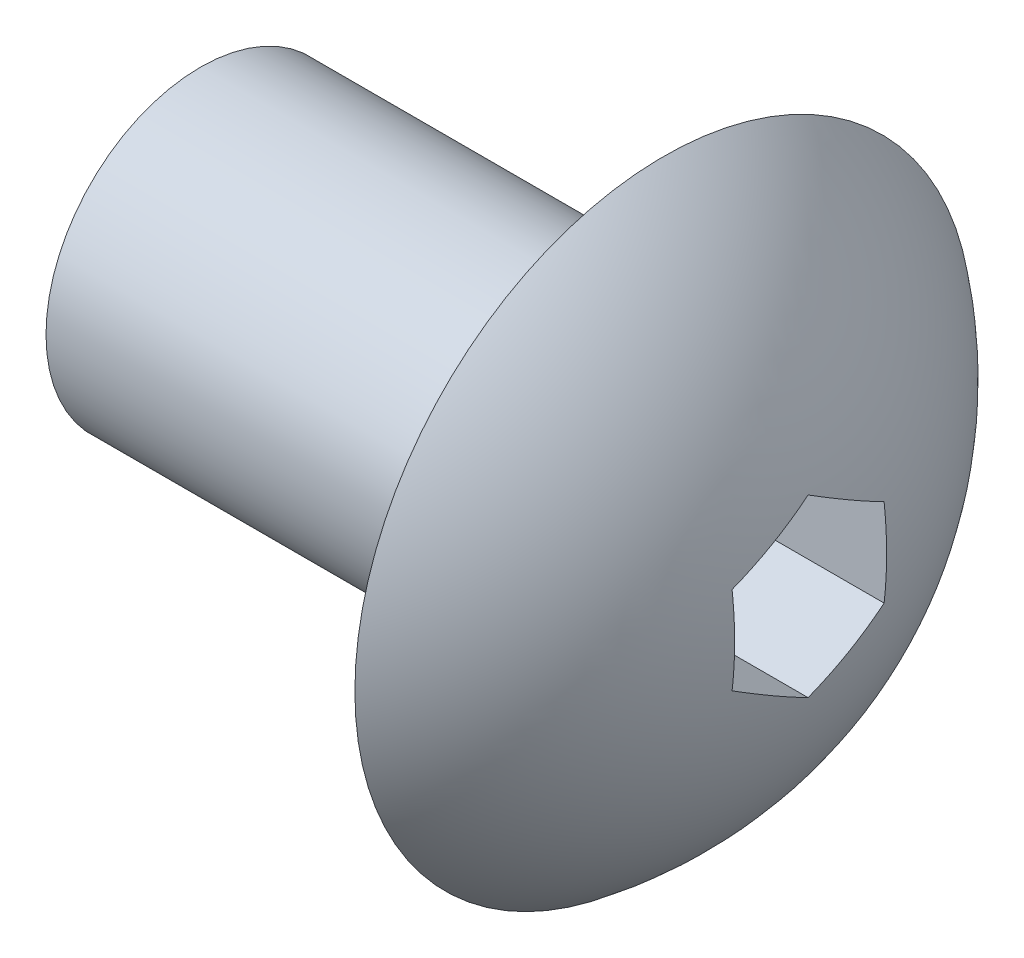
ISO-10303-21;
HEADER;
FILE_DESCRIPTION(('STEP AP214'),'2;1');
FILE_NAME('part.step','',(''),(''),'','','');
FILE_SCHEMA(('AUTOMOTIVE_DESIGN { 1 0 10303 214 1 1 1 1 }'));
ENDSEC;
DATA;
#1=APPLICATION_CONTEXT('core data for automotive mechanical design processes');
#2=APPLICATION_PROTOCOL_DEFINITION('international standard','automotive_design',2000,#1);
#3=PRODUCT_CONTEXT('',#1,'mechanical');
#4=PRODUCT('Part','Part','',(#3));
#5=PRODUCT_RELATED_PRODUCT_CATEGORY('part','',(#4));
#6=PRODUCT_DEFINITION_FORMATION('','',#4);
#7=PRODUCT_DEFINITION_CONTEXT('part definition',#1,'design');
#8=PRODUCT_DEFINITION('design','',#6,#7);
#9=PRODUCT_DEFINITION_SHAPE('','',#8);
#10=(LENGTH_UNIT() NAMED_UNIT(*) SI_UNIT(.MILLI.,.METRE.));
#11=(NAMED_UNIT(*) PLANE_ANGLE_UNIT() SI_UNIT($,.RADIAN.));
#12=(NAMED_UNIT(*) SI_UNIT($,.STERADIAN.) SOLID_ANGLE_UNIT());
#13=UNCERTAINTY_MEASURE_WITH_UNIT(LENGTH_MEASURE(1.E-05),#10,'distance_accuracy_value','');
#14=(GEOMETRIC_REPRESENTATION_CONTEXT(3) GLOBAL_UNCERTAINTY_ASSIGNED_CONTEXT((#13)) GLOBAL_UNIT_ASSIGNED_CONTEXT((#10,
#11,#12)) REPRESENTATION_CONTEXT('',''));
#15=CARTESIAN_POINT('',(0.,0.,0.));
#16=DIRECTION('',(0.,0.,1.));
#17=DIRECTION('',(1.,0.,0.));
#18=AXIS2_PLACEMENT_3D('',#15,#16,#17);
#19=CARTESIAN_POINT('',(0.,0.,0.));
#20=DIRECTION('',(-1.,0.,0.));
#21=DIRECTION('',(0.,0.,1.));
#22=AXIS2_PLACEMENT_3D('',#19,#20,#21);
#23=PLANE('',#22);
#24=CARTESIAN_POINT('',(0.,0.,0.));
#25=DIRECTION('',(-1.,0.,0.));
#26=DIRECTION('',(0.,0.,1.));
#27=AXIS2_PLACEMENT_3D('',#24,#25,#26);
#28=CIRCLE('',#27,2.54);
#29=CARTESIAN_POINT('',(0.,0.,2.54));
#30=VERTEX_POINT('',#29);
#31=EDGE_CURVE('E129',#30,#30,#28,.T.);
#32=ORIENTED_EDGE('',*,*,#31,.T.);
#33=EDGE_LOOP('',(#32));
#34=FACE_BOUND('',#33,.T.);
#35=ADVANCED_FACE('F32',(#34),#23,.T.);
#36=CARTESIAN_POINT('',(0.,0.,0.));
#37=DIRECTION('',(-1.,0.,0.));
#38=DIRECTION('',(0.,0.,1.));
#39=AXIS2_PLACEMENT_3D('',#36,#37,#38);
#40=CYLINDRICAL_SURFACE('',#39,2.54);
#41=CARTESIAN_POINT('',(7.62,0.,0.));
#42=DIRECTION('',(-1.,0.,0.));
#43=DIRECTION('',(0.,0.,1.));
#44=AXIS2_PLACEMENT_3D('',#41,#42,#43);
#45=CIRCLE('',#44,2.54);
#46=CARTESIAN_POINT('',(7.62,0.,2.54));
#47=VERTEX_POINT('',#46);
#48=EDGE_CURVE('E126',#47,#47,#45,.T.);
#49=ORIENTED_EDGE('',*,*,#48,.T.);
#50=EDGE_LOOP('',(#49));
#51=FACE_BOUND('',#50,.T.);
#52=ORIENTED_EDGE('',*,*,#31,.F.);
#53=EDGE_LOOP('',(#52));
#54=FACE_BOUND('',#53,.T.);
#55=ADVANCED_FACE('F163',(#51,#54),#40,.T.);
#56=CARTESIAN_POINT('',(7.62,0.,2.54));
#57=DIRECTION('',(-1.,0.,0.));
#58=DIRECTION('',(0.,0.,1.));
#59=AXIS2_PLACEMENT_3D('',#56,#57,#58);
#60=PLANE('',#59);
#61=CARTESIAN_POINT('',(7.62,0.,0.));
#62=DIRECTION('',(-1.,0.,0.));
#63=DIRECTION('',(0.,0.,1.));
#64=AXIS2_PLACEMENT_3D('',#61,#62,#63);
#65=CIRCLE('',#64,5.08);
#66=CARTESIAN_POINT('',(7.62,0.,5.08));
#67=VERTEX_POINT('',#66);
#68=EDGE_CURVE('E114',#67,#67,#65,.T.);
#69=ORIENTED_EDGE('',*,*,#68,.T.);
#70=EDGE_LOOP('',(#69));
#71=FACE_BOUND('',#70,.T.);
#72=ORIENTED_EDGE('',*,*,#48,.F.);
#73=EDGE_LOOP('',(#72));
#74=FACE_BOUND('',#73,.T.);
#75=ADVANCED_FACE('F168',(#71,#74),#60,.T.);
#76=CARTESIAN_POINT('',(3.81,0.,0.));
#77=DIRECTION('',(-1.,0.,0.));
#78=DIRECTION('',(0.,0.,1.));
#79=AXIS2_PLACEMENT_3D('',#76,#77,#78);
#80=SPHERICAL_SURFACE('',#79,6.35);
#81=CARTESIAN_POINT('',(3.81,-1.08253175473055,0.625));
#82=DIRECTION('',(0.,-0.866025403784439,0.5));
#83=DIRECTION('',(0.,-0.5,-0.866025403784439));
#84=AXIS2_PLACEMENT_3D('',#81,#82,#83);
#85=CIRCLE('',#84,6.22575296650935);
#86=CARTESIAN_POINT('',(9.99378255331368,-0.721687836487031,1.25));
#87=VERTEX_POINT('',#86);
#88=CARTESIAN_POINT('',(9.99378255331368,-1.44337567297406,0.));
#89=VERTEX_POINT('',#88);
#90=EDGE_CURVE('E11',#87,#89,#85,.F.);
#91=ORIENTED_EDGE('',*,*,#90,.F.);
#92=CARTESIAN_POINT('',(3.81,0.,1.25));
#93=DIRECTION('',(0.,0.,1.));
#94=DIRECTION('',(1.,0.,0.));
#95=AXIS2_PLACEMENT_3D('',#92,#93,#94);
#96=CIRCLE('',#95,6.22575296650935);
#97=CARTESIAN_POINT('',(9.99378255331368,0.721687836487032,1.25));
#98=VERTEX_POINT('',#97);
#99=EDGE_CURVE('E39',#98,#87,#96,.F.);
#100=ORIENTED_EDGE('',*,*,#99,.F.);
#101=CARTESIAN_POINT('',(3.81,1.08253175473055,0.625));
#102=DIRECTION('',(0.,0.866025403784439,0.5));
#103=DIRECTION('',(0.,-0.5,0.866025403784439));
#104=AXIS2_PLACEMENT_3D('',#101,#102,#103);
#105=CIRCLE('',#104,6.22575296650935);
#106=CARTESIAN_POINT('',(9.99378255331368,1.44337567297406,0.));
#107=VERTEX_POINT('',#106);
#108=EDGE_CURVE('E138',#107,#98,#105,.F.);
#109=ORIENTED_EDGE('',*,*,#108,.F.);
#110=CARTESIAN_POINT('',(3.81,1.08253175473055,-0.625));
#111=DIRECTION('',(0.,0.866025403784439,-0.5));
#112=DIRECTION('',(0.,0.5,0.866025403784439));
#113=AXIS2_PLACEMENT_3D('',#110,#111,#112);
#114=CIRCLE('',#113,6.22575296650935);
#115=CARTESIAN_POINT('',(9.99378255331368,0.721687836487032,-1.25));
#116=VERTEX_POINT('',#115);
#117=EDGE_CURVE('E136',#116,#107,#114,.F.);
#118=ORIENTED_EDGE('',*,*,#117,.F.);
#119=CARTESIAN_POINT('',(3.81,0.,-1.25));
#120=DIRECTION('',(0.,0.,-1.));
#121=DIRECTION('',(-1.,0.,0.));
#122=AXIS2_PLACEMENT_3D('',#119,#120,#121);
#123=CIRCLE('',#122,6.22575296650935);
#124=CARTESIAN_POINT('',(9.99378255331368,-0.721687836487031,-1.25));
#125=VERTEX_POINT('',#124);
#126=EDGE_CURVE('E134',#125,#116,#123,.F.);
#127=ORIENTED_EDGE('',*,*,#126,.F.);
#128=CARTESIAN_POINT('',(3.81,-1.08253175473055,-0.625));
#129=DIRECTION('',(0.,-0.866025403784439,-0.5));
#130=DIRECTION('',(0.,0.5,-0.866025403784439));
#131=AXIS2_PLACEMENT_3D('',#128,#129,#130);
#132=CIRCLE('',#131,6.22575296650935);
#133=EDGE_CURVE('E132',#89,#125,#132,.F.);
#134=ORIENTED_EDGE('',*,*,#133,.F.);
#135=EDGE_LOOP('',(#91,#100,#109,#118,#127,#134));
#136=FACE_BOUND('',#135,.T.);
#137=ORIENTED_EDGE('',*,*,#68,.F.);
#138=EDGE_LOOP('',(#137));
#139=FACE_BOUND('',#138,.T.);
#140=ADVANCED_FACE('F146',(#136,#139),#80,.T.);
#141=CARTESIAN_POINT('',(6.35,-0.721687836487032,1.25));
#142=DIRECTION('',(0.,-0.866025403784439,0.5));
#143=DIRECTION('',(0.,-0.5,-0.866025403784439));
#144=AXIS2_PLACEMENT_3D('',#141,#142,#143);
#145=PLANE('',#144);
#146=ORIENTED_EDGE('',*,*,#90,.T.);
#147=DIRECTION('',(1.,0.,0.));
#148=VECTOR('',#147,1.);
#149=CARTESIAN_POINT('',(6.35,-1.44337567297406,0.));
#150=LINE('',#149,#148);
#151=CARTESIAN_POINT('',(6.35,-1.44337567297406,0.));
#152=VERTEX_POINT('',#151);
#153=EDGE_CURVE('E46',#152,#89,#150,.T.);
#154=ORIENTED_EDGE('',*,*,#153,.F.);
#155=DIRECTION('',(0.,-0.5,-0.866025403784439));
#156=VECTOR('',#155,1.);
#157=CARTESIAN_POINT('',(6.35,-0.721687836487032,1.25));
#158=LINE('',#157,#156);
#159=CARTESIAN_POINT('',(6.35,-0.721687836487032,1.25));
#160=VERTEX_POINT('',#159);
#161=EDGE_CURVE('E84',#160,#152,#158,.T.);
#162=ORIENTED_EDGE('',*,*,#161,.F.);
#163=DIRECTION('',(1.,0.,0.));
#164=VECTOR('',#163,1.);
#165=CARTESIAN_POINT('',(6.35,-0.721687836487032,1.25));
#166=LINE('',#165,#164);
#167=EDGE_CURVE('E112',#160,#87,#166,.T.);
#168=ORIENTED_EDGE('',*,*,#167,.T.);
#169=EDGE_LOOP('',(#146,#154,#162,#168));
#170=FACE_BOUND('',#169,.T.);
#171=ADVANCED_FACE('F82',(#170),#145,.F.);
#172=CARTESIAN_POINT('',(6.35,0.721687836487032,1.25));
#173=DIRECTION('',(0.,0.,1.));
#174=DIRECTION('',(1.,0.,0.));
#175=AXIS2_PLACEMENT_3D('',#172,#173,#174);
#176=PLANE('',#175);
#177=ORIENTED_EDGE('',*,*,#99,.T.);
#178=ORIENTED_EDGE('',*,*,#167,.F.);
#179=DIRECTION('',(0.,-1.,0.));
#180=VECTOR('',#179,1.);
#181=CARTESIAN_POINT('',(6.35,0.721687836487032,1.25));
#182=LINE('',#181,#180);
#183=CARTESIAN_POINT('',(6.35,0.721687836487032,1.25));
#184=VERTEX_POINT('',#183);
#185=EDGE_CURVE('E89',#184,#160,#182,.T.);
#186=ORIENTED_EDGE('',*,*,#185,.F.);
#187=DIRECTION('',(1.,0.,0.));
#188=VECTOR('',#187,1.);
#189=CARTESIAN_POINT('',(6.35,0.721687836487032,1.25));
#190=LINE('',#189,#188);
#191=EDGE_CURVE('E115',#184,#98,#190,.T.);
#192=ORIENTED_EDGE('',*,*,#191,.T.);
#193=EDGE_LOOP('',(#177,#178,#186,#192));
#194=FACE_BOUND('',#193,.T.);
#195=ADVANCED_FACE('F145',(#194),#176,.F.);
#196=CARTESIAN_POINT('',(6.35,1.44337567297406,0.));
#197=DIRECTION('',(0.,0.866025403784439,0.5));
#198=DIRECTION('',(0.,-0.5,0.866025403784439));
#199=AXIS2_PLACEMENT_3D('',#196,#197,#198);
#200=PLANE('',#199);
#201=ORIENTED_EDGE('',*,*,#108,.T.);
#202=ORIENTED_EDGE('',*,*,#191,.F.);
#203=DIRECTION('',(0.,-0.5,0.866025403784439));
#204=VECTOR('',#203,1.);
#205=CARTESIAN_POINT('',(6.35,1.44337567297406,0.));
#206=LINE('',#205,#204);
#207=CARTESIAN_POINT('',(6.35,1.44337567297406,0.));
#208=VERTEX_POINT('',#207);
#209=EDGE_CURVE('E109',#208,#184,#206,.T.);
#210=ORIENTED_EDGE('',*,*,#209,.F.);
#211=DIRECTION('',(1.,0.,0.));
#212=VECTOR('',#211,1.);
#213=CARTESIAN_POINT('',(6.35,1.44337567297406,0.));
#214=LINE('',#213,#212);
#215=EDGE_CURVE('E117',#208,#107,#214,.T.);
#216=ORIENTED_EDGE('',*,*,#215,.T.);
#217=EDGE_LOOP('',(#201,#202,#210,#216));
#218=FACE_BOUND('',#217,.T.);
#219=ADVANCED_FACE('F141',(#218),#200,.F.);
#220=CARTESIAN_POINT('',(6.35,0.721687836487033,-1.25));
#221=DIRECTION('',(0.,0.866025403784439,-0.5));
#222=DIRECTION('',(0.,0.5,0.866025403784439));
#223=AXIS2_PLACEMENT_3D('',#220,#221,#222);
#224=PLANE('',#223);
#225=ORIENTED_EDGE('',*,*,#117,.T.);
#226=ORIENTED_EDGE('',*,*,#215,.F.);
#227=DIRECTION('',(0.,0.5,0.866025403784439));
#228=VECTOR('',#227,1.);
#229=CARTESIAN_POINT('',(6.35,0.721687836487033,-1.25));
#230=LINE('',#229,#228);
#231=CARTESIAN_POINT('',(6.35,0.721687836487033,-1.25));
#232=VERTEX_POINT('',#231);
#233=EDGE_CURVE('E106',#232,#208,#230,.T.);
#234=ORIENTED_EDGE('',*,*,#233,.F.);
#235=DIRECTION('',(1.,0.,0.));
#236=VECTOR('',#235,1.);
#237=CARTESIAN_POINT('',(6.35,0.721687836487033,-1.25));
#238=LINE('',#237,#236);
#239=EDGE_CURVE('E120',#232,#116,#238,.T.);
#240=ORIENTED_EDGE('',*,*,#239,.T.);
#241=EDGE_LOOP('',(#225,#226,#234,#240));
#242=FACE_BOUND('',#241,.T.);
#243=ADVANCED_FACE('F153',(#242),#224,.F.);
#244=CARTESIAN_POINT('',(6.35,-0.721687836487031,-1.25));
#245=DIRECTION('',(0.,0.,-1.));
#246=DIRECTION('',(-1.,0.,0.));
#247=AXIS2_PLACEMENT_3D('',#244,#245,#246);
#248=PLANE('',#247);
#249=ORIENTED_EDGE('',*,*,#126,.T.);
#250=ORIENTED_EDGE('',*,*,#239,.F.);
#251=DIRECTION('',(0.,1.,0.));
#252=VECTOR('',#251,1.);
#253=CARTESIAN_POINT('',(6.35,-0.721687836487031,-1.25));
#254=LINE('',#253,#252);
#255=CARTESIAN_POINT('',(6.35,-0.721687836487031,-1.25));
#256=VERTEX_POINT('',#255);
#257=EDGE_CURVE('E98',#256,#232,#254,.T.);
#258=ORIENTED_EDGE('',*,*,#257,.F.);
#259=DIRECTION('',(1.,0.,0.));
#260=VECTOR('',#259,1.);
#261=CARTESIAN_POINT('',(6.35,-0.721687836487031,-1.25));
#262=LINE('',#261,#260);
#263=EDGE_CURVE('E88',#256,#125,#262,.T.);
#264=ORIENTED_EDGE('',*,*,#263,.T.);
#265=EDGE_LOOP('',(#249,#250,#258,#264));
#266=FACE_BOUND('',#265,.T.);
#267=ADVANCED_FACE('F150',(#266),#248,.F.);
#268=CARTESIAN_POINT('',(6.35,-1.44337567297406,0.));
#269=DIRECTION('',(0.,-0.866025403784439,-0.5));
#270=DIRECTION('',(0.,0.5,-0.866025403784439));
#271=AXIS2_PLACEMENT_3D('',#268,#269,#270);
#272=PLANE('',#271);
#273=ORIENTED_EDGE('',*,*,#133,.T.);
#274=ORIENTED_EDGE('',*,*,#263,.F.);
#275=DIRECTION('',(0.,0.5,-0.866025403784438));
#276=VECTOR('',#275,1.);
#277=CARTESIAN_POINT('',(6.35,-1.44337567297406,0.));
#278=LINE('',#277,#276);
#279=EDGE_CURVE('E92',#152,#256,#278,.T.);
#280=ORIENTED_EDGE('',*,*,#279,.F.);
#281=ORIENTED_EDGE('',*,*,#153,.T.);
#282=EDGE_LOOP('',(#273,#274,#280,#281));
#283=FACE_BOUND('',#282,.T.);
#284=ADVANCED_FACE('F93',(#283),#272,.F.);
#285=CARTESIAN_POINT('',(6.35,-1.44337567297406,0.));
#286=DIRECTION('',(1.,0.,0.));
#287=DIRECTION('',(0.,0.,-1.));
#288=AXIS2_PLACEMENT_3D('',#285,#286,#287);
#289=PLANE('',#288);
#290=ORIENTED_EDGE('',*,*,#161,.T.);
#291=ORIENTED_EDGE('',*,*,#279,.T.);
#292=ORIENTED_EDGE('',*,*,#257,.T.);
#293=ORIENTED_EDGE('',*,*,#233,.T.);
#294=ORIENTED_EDGE('',*,*,#209,.T.);
#295=ORIENTED_EDGE('',*,*,#185,.T.);
#296=EDGE_LOOP('',(#290,#291,#292,#293,#294,#295));
#297=FACE_BOUND('',#296,.T.);
#298=ADVANCED_FACE('F100',(#297),#289,.T.);
#299=CLOSED_SHELL('',(#35,#55,#75,#140,#171,#195,#219,#243,#267,#284,#298));
#300=MANIFOLD_SOLID_BREP('B2',#299);
#301=ADVANCED_BREP_SHAPE_REPRESENTATION('',(#18,#300),#14);
#302=SHAPE_DEFINITION_REPRESENTATION(#9,#301);
ENDSEC;
END-ISO-10303-21;
